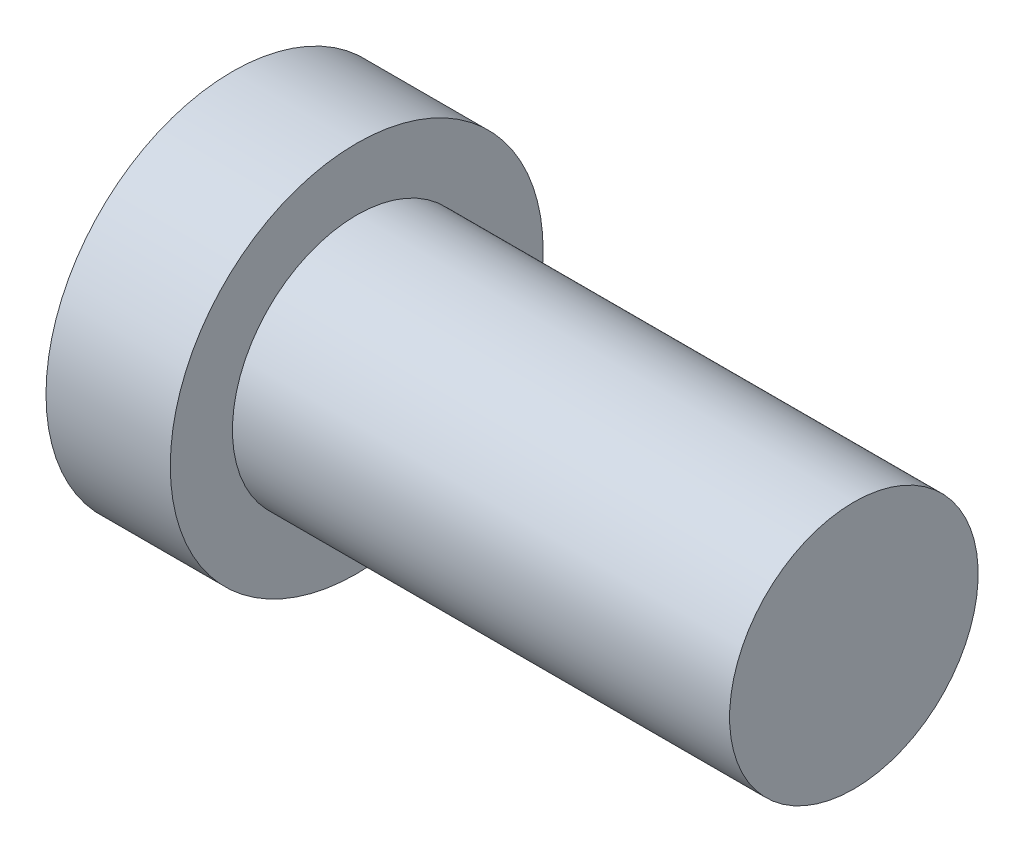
ISO-10303-21;
HEADER;
FILE_DESCRIPTION(('STEP AP214'),'2;1');
FILE_NAME('part.step','',(''),(''),'','','');
FILE_SCHEMA(('AUTOMOTIVE_DESIGN { 1 0 10303 214 1 1 1 1 }'));
ENDSEC;
DATA;
#1=APPLICATION_CONTEXT('core data for automotive mechanical design processes');
#2=APPLICATION_PROTOCOL_DEFINITION('international standard','automotive_design',2000,#1);
#3=PRODUCT_CONTEXT('',#1,'mechanical');
#4=PRODUCT('Part','Part','',(#3));
#5=PRODUCT_RELATED_PRODUCT_CATEGORY('part','',(#4));
#6=PRODUCT_DEFINITION_FORMATION('','',#4);
#7=PRODUCT_DEFINITION_CONTEXT('part definition',#1,'design');
#8=PRODUCT_DEFINITION('design','',#6,#7);
#9=PRODUCT_DEFINITION_SHAPE('','',#8);
#10=(LENGTH_UNIT() NAMED_UNIT(*) SI_UNIT(.MILLI.,.METRE.));
#11=(NAMED_UNIT(*) PLANE_ANGLE_UNIT() SI_UNIT($,.RADIAN.));
#12=(NAMED_UNIT(*) SI_UNIT($,.STERADIAN.) SOLID_ANGLE_UNIT());
#13=UNCERTAINTY_MEASURE_WITH_UNIT(LENGTH_MEASURE(1.E-05),#10,'distance_accuracy_value','');
#14=(GEOMETRIC_REPRESENTATION_CONTEXT(3) GLOBAL_UNCERTAINTY_ASSIGNED_CONTEXT((#13)) GLOBAL_UNIT_ASSIGNED_CONTEXT((#10,
#11,#12)) REPRESENTATION_CONTEXT('',''));
#15=CARTESIAN_POINT('',(0.,0.,0.));
#16=DIRECTION('',(0.,0.,1.));
#17=DIRECTION('',(1.,0.,0.));
#18=AXIS2_PLACEMENT_3D('',#15,#16,#17);
#19=CARTESIAN_POINT('',(0.,0.,0.));
#20=DIRECTION('',(-1.,0.,0.));
#21=DIRECTION('',(0.,-1.,0.));
#22=AXIS2_PLACEMENT_3D('',#19,#20,#21);
#23=PLANE('',#22);
#24=CARTESIAN_POINT('',(0.,0.,0.));
#25=DIRECTION('',(1.,0.,0.));
#26=DIRECTION('',(0.,1.,0.));
#27=AXIS2_PLACEMENT_3D('',#24,#25,#26);
#28=CIRCLE('',#27,3.81);
#29=CARTESIAN_POINT('',(0.,3.81,0.));
#30=VERTEX_POINT('',#29);
#31=EDGE_CURVE('E10',#30,#30,#28,.T.);
#32=ORIENTED_EDGE('',*,*,#31,.F.);
#33=EDGE_LOOP('',(#32));
#34=FACE_BOUND('',#33,.T.);
#35=ADVANCED_FACE('F30',(#34),#23,.T.);
#36=CARTESIAN_POINT('',(12.7,0.,0.));
#37=DIRECTION('',(1.,0.,0.));
#38=DIRECTION('',(0.,1.,0.));
#39=AXIS2_PLACEMENT_3D('',#36,#37,#38);
#40=CYLINDRICAL_SURFACE('',#39,3.81);
#41=ORIENTED_EDGE('',*,*,#31,.T.);
#42=EDGE_LOOP('',(#41));
#43=FACE_BOUND('',#42,.T.);
#44=CARTESIAN_POINT('',(2.54,0.,0.));
#45=DIRECTION('',(1.,0.,0.));
#46=DIRECTION('',(0.,1.,0.));
#47=AXIS2_PLACEMENT_3D('',#44,#45,#46);
#48=CIRCLE('',#47,3.81);
#49=CARTESIAN_POINT('',(2.54,3.81,0.));
#50=VERTEX_POINT('',#49);
#51=EDGE_CURVE('E36',#50,#50,#48,.T.);
#52=ORIENTED_EDGE('',*,*,#51,.F.);
#53=EDGE_LOOP('',(#52));
#54=FACE_BOUND('',#53,.T.);
#55=ADVANCED_FACE('F62',(#43,#54),#40,.T.);
#56=CARTESIAN_POINT('',(2.54,3.81,0.));
#57=DIRECTION('',(1.,0.,0.));
#58=DIRECTION('',(0.,1.,0.));
#59=AXIS2_PLACEMENT_3D('',#56,#57,#58);
#60=PLANE('',#59);
#61=ORIENTED_EDGE('',*,*,#51,.T.);
#62=EDGE_LOOP('',(#61));
#63=FACE_BOUND('',#62,.T.);
#64=CARTESIAN_POINT('',(2.54,0.,0.));
#65=DIRECTION('',(1.,0.,0.));
#66=DIRECTION('',(0.,1.,0.));
#67=AXIS2_PLACEMENT_3D('',#64,#65,#66);
#68=CIRCLE('',#67,2.54);
#69=CARTESIAN_POINT('',(2.54,2.54,0.));
#70=VERTEX_POINT('',#69);
#71=EDGE_CURVE('E40',#70,#70,#68,.T.);
#72=ORIENTED_EDGE('',*,*,#71,.F.);
#73=EDGE_LOOP('',(#72));
#74=FACE_BOUND('',#73,.T.);
#75=ADVANCED_FACE('F54',(#63,#74),#60,.T.);
#76=CARTESIAN_POINT('',(12.7,0.,0.));
#77=DIRECTION('',(1.,0.,0.));
#78=DIRECTION('',(0.,1.,0.));
#79=AXIS2_PLACEMENT_3D('',#76,#77,#78);
#80=CYLINDRICAL_SURFACE('',#79,2.54);
#81=ORIENTED_EDGE('',*,*,#71,.T.);
#82=EDGE_LOOP('',(#81));
#83=FACE_BOUND('',#82,.T.);
#84=CARTESIAN_POINT('',(12.7,0.,0.));
#85=DIRECTION('',(1.,0.,0.));
#86=DIRECTION('',(0.,1.,0.));
#87=AXIS2_PLACEMENT_3D('',#84,#85,#86);
#88=CIRCLE('',#87,2.54);
#89=CARTESIAN_POINT('',(12.7,2.54,0.));
#90=VERTEX_POINT('',#89);
#91=EDGE_CURVE('E44',#90,#90,#88,.T.);
#92=ORIENTED_EDGE('',*,*,#91,.F.);
#93=EDGE_LOOP('',(#92));
#94=FACE_BOUND('',#93,.T.);
#95=ADVANCED_FACE('F52',(#83,#94),#80,.T.);
#96=CARTESIAN_POINT('',(12.7,2.54,0.));
#97=DIRECTION('',(1.,0.,0.));
#98=DIRECTION('',(0.,1.,0.));
#99=AXIS2_PLACEMENT_3D('',#96,#97,#98);
#100=PLANE('',#99);
#101=ORIENTED_EDGE('',*,*,#91,.T.);
#102=EDGE_LOOP('',(#101));
#103=FACE_BOUND('',#102,.T.);
#104=ADVANCED_FACE('F50',(#103),#100,.T.);
#105=CLOSED_SHELL('',(#35,#55,#75,#95,#104));
#106=MANIFOLD_SOLID_BREP('B2',#105);
#107=ADVANCED_BREP_SHAPE_REPRESENTATION('',(#18,#106),#14);
#108=SHAPE_DEFINITION_REPRESENTATION(#9,#107);
ENDSEC;
END-ISO-10303-21;
